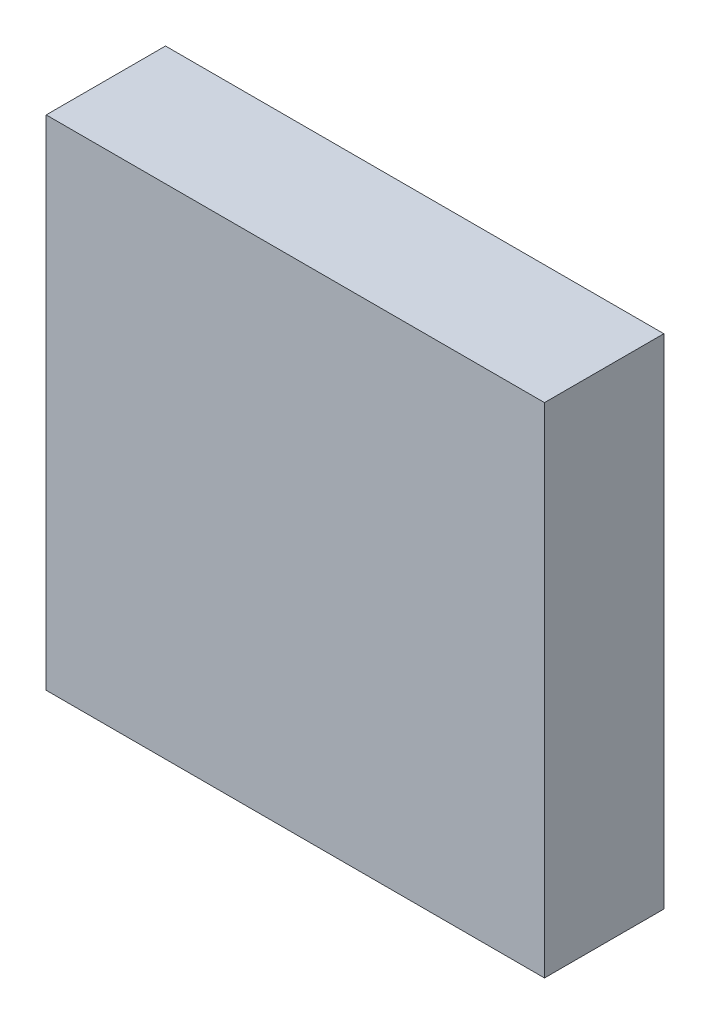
ISO-10303-21;
HEADER;
FILE_DESCRIPTION(('STEP AP214'),'2;1');
FILE_NAME('part.step','',(''),(''),'','','');
FILE_SCHEMA(('AUTOMOTIVE_DESIGN { 1 0 10303 214 1 1 1 1 }'));
ENDSEC;
DATA;
#1=APPLICATION_CONTEXT('core data for automotive mechanical design processes');
#2=APPLICATION_PROTOCOL_DEFINITION('international standard','automotive_design',2000,#1);
#3=PRODUCT_CONTEXT('',#1,'mechanical');
#4=PRODUCT('Part','Part','',(#3));
#5=PRODUCT_RELATED_PRODUCT_CATEGORY('part','',(#4));
#6=PRODUCT_DEFINITION_FORMATION('','',#4);
#7=PRODUCT_DEFINITION_CONTEXT('part definition',#1,'design');
#8=PRODUCT_DEFINITION('design','',#6,#7);
#9=PRODUCT_DEFINITION_SHAPE('','',#8);
#10=(LENGTH_UNIT() NAMED_UNIT(*) SI_UNIT(.MILLI.,.METRE.));
#11=(NAMED_UNIT(*) PLANE_ANGLE_UNIT() SI_UNIT($,.RADIAN.));
#12=(NAMED_UNIT(*) SI_UNIT($,.STERADIAN.) SOLID_ANGLE_UNIT());
#13=UNCERTAINTY_MEASURE_WITH_UNIT(LENGTH_MEASURE(1.E-05),#10,'distance_accuracy_value','');
#14=(GEOMETRIC_REPRESENTATION_CONTEXT(3) GLOBAL_UNCERTAINTY_ASSIGNED_CONTEXT((#13)) GLOBAL_UNIT_ASSIGNED_CONTEXT((#10,
#11,#12)) REPRESENTATION_CONTEXT('',''));
#15=CARTESIAN_POINT('',(0.,0.,0.));
#16=DIRECTION('',(0.,0.,1.));
#17=DIRECTION('',(1.,0.,0.));
#18=AXIS2_PLACEMENT_3D('',#15,#16,#17);
#19=CARTESIAN_POINT('',(-15.875,15.875,0.254));
#20=DIRECTION('',(0.,1.,0.));
#21=DIRECTION('',(-1.,0.,0.));
#22=AXIS2_PLACEMENT_3D('',#19,#20,#21);
#23=PLANE('',#22);
#24=DIRECTION('',(0.,0.,1.));
#25=VECTOR('',#24,1.);
#26=CARTESIAN_POINT('',(-15.875,15.875,0.254));
#27=LINE('',#26,#25);
#28=CARTESIAN_POINT('',(-15.875,15.875,0.));
#29=VERTEX_POINT('',#28);
#30=CARTESIAN_POINT('',(-15.875,15.875,7.60273));
#31=VERTEX_POINT('',#30);
#32=EDGE_CURVE('E61',#29,#31,#27,.T.);
#33=ORIENTED_EDGE('',*,*,#32,.T.);
#34=DIRECTION('',(-1.,0.,0.));
#35=VECTOR('',#34,1.);
#36=CARTESIAN_POINT('',(15.875,15.875,7.60273));
#37=LINE('',#36,#35);
#38=CARTESIAN_POINT('',(15.875,15.875,7.60273));
#39=VERTEX_POINT('',#38);
#40=EDGE_CURVE('E73',#39,#31,#37,.T.);
#41=ORIENTED_EDGE('',*,*,#40,.F.);
#42=DIRECTION('',(0.,0.,1.));
#43=VECTOR('',#42,1.);
#44=CARTESIAN_POINT('',(15.875,15.875,0.254));
#45=LINE('',#44,#43);
#46=CARTESIAN_POINT('',(15.875,15.875,0.));
#47=VERTEX_POINT('',#46);
#48=EDGE_CURVE('E80',#47,#39,#45,.T.);
#49=ORIENTED_EDGE('',*,*,#48,.F.);
#50=DIRECTION('',(-1.,0.,0.));
#51=VECTOR('',#50,1.);
#52=CARTESIAN_POINT('',(-15.875,15.875,0.));
#53=LINE('',#52,#51);
#54=EDGE_CURVE('E83',#47,#29,#53,.T.);
#55=ORIENTED_EDGE('',*,*,#54,.T.);
#56=EDGE_LOOP('',(#33,#41,#49,#55));
#57=FACE_BOUND('',#56,.T.);
#58=ADVANCED_FACE('F14',(#57),#23,.T.);
#59=CARTESIAN_POINT('',(15.875,15.875,0.254));
#60=DIRECTION('',(1.,0.,0.));
#61=DIRECTION('',(0.,1.,0.));
#62=AXIS2_PLACEMENT_3D('',#59,#60,#61);
#63=PLANE('',#62);
#64=ORIENTED_EDGE('',*,*,#48,.T.);
#65=DIRECTION('',(0.,1.,0.));
#66=VECTOR('',#65,1.);
#67=CARTESIAN_POINT('',(15.875,-15.875,7.60273));
#68=LINE('',#67,#66);
#69=CARTESIAN_POINT('',(15.875,-15.875,7.60273));
#70=VERTEX_POINT('',#69);
#71=EDGE_CURVE('E68',#70,#39,#68,.T.);
#72=ORIENTED_EDGE('',*,*,#71,.F.);
#73=DIRECTION('',(0.,0.,1.));
#74=VECTOR('',#73,1.);
#75=CARTESIAN_POINT('',(15.875,-15.875,0.254));
#76=LINE('',#75,#74);
#77=CARTESIAN_POINT('',(15.875,-15.875,0.));
#78=VERTEX_POINT('',#77);
#79=EDGE_CURVE('E9',#78,#70,#76,.T.);
#80=ORIENTED_EDGE('',*,*,#79,.F.);
#81=DIRECTION('',(0.,1.,0.));
#82=VECTOR('',#81,1.);
#83=CARTESIAN_POINT('',(15.875,15.875,0.));
#84=LINE('',#83,#82);
#85=EDGE_CURVE('E77',#78,#47,#84,.T.);
#86=ORIENTED_EDGE('',*,*,#85,.T.);
#87=EDGE_LOOP('',(#64,#72,#80,#86));
#88=FACE_BOUND('',#87,.T.);
#89=ADVANCED_FACE('F87',(#88),#63,.T.);
#90=CARTESIAN_POINT('',(-15.875,15.875,0.254));
#91=DIRECTION('',(-1.,0.,0.));
#92=DIRECTION('',(0.,-1.,0.));
#93=AXIS2_PLACEMENT_3D('',#90,#91,#92);
#94=PLANE('',#93);
#95=DIRECTION('',(0.,0.,1.));
#96=VECTOR('',#95,1.);
#97=CARTESIAN_POINT('',(-15.875,-15.875,0.254));
#98=LINE('',#97,#96);
#99=CARTESIAN_POINT('',(-15.875,-15.875,0.));
#100=VERTEX_POINT('',#99);
#101=CARTESIAN_POINT('',(-15.875,-15.875,7.60273));
#102=VERTEX_POINT('',#101);
#103=EDGE_CURVE('E23',#100,#102,#98,.T.);
#104=ORIENTED_EDGE('',*,*,#103,.T.);
#105=DIRECTION('',(0.,-1.,0.));
#106=VECTOR('',#105,1.);
#107=CARTESIAN_POINT('',(-15.875,15.875,7.60273));
#108=LINE('',#107,#106);
#109=EDGE_CURVE('E57',#31,#102,#108,.T.);
#110=ORIENTED_EDGE('',*,*,#109,.F.);
#111=ORIENTED_EDGE('',*,*,#32,.F.);
#112=DIRECTION('',(0.,-1.,0.));
#113=VECTOR('',#112,1.);
#114=CARTESIAN_POINT('',(-15.875,15.875,0.));
#115=LINE('',#114,#113);
#116=EDGE_CURVE('E59',#29,#100,#115,.T.);
#117=ORIENTED_EDGE('',*,*,#116,.T.);
#118=EDGE_LOOP('',(#104,#110,#111,#117));
#119=FACE_BOUND('',#118,.T.);
#120=ADVANCED_FACE('F55',(#119),#94,.T.);
#121=CARTESIAN_POINT('',(-15.875,-15.875,0.254));
#122=DIRECTION('',(0.,-1.,0.));
#123=DIRECTION('',(1.,0.,0.));
#124=AXIS2_PLACEMENT_3D('',#121,#122,#123);
#125=PLANE('',#124);
#126=ORIENTED_EDGE('',*,*,#79,.T.);
#127=DIRECTION('',(1.,0.,0.));
#128=VECTOR('',#127,1.);
#129=CARTESIAN_POINT('',(-15.875,-15.875,7.60273));
#130=LINE('',#129,#128);
#131=EDGE_CURVE('E64',#102,#70,#130,.T.);
#132=ORIENTED_EDGE('',*,*,#131,.F.);
#133=ORIENTED_EDGE('',*,*,#103,.F.);
#134=DIRECTION('',(1.,0.,0.));
#135=VECTOR('',#134,1.);
#136=CARTESIAN_POINT('',(-15.875,-15.875,0.));
#137=LINE('',#136,#135);
#138=EDGE_CURVE('E18',#100,#78,#137,.T.);
#139=ORIENTED_EDGE('',*,*,#138,.T.);
#140=EDGE_LOOP('',(#126,#132,#133,#139));
#141=FACE_BOUND('',#140,.T.);
#142=ADVANCED_FACE('F65',(#141),#125,.T.);
#143=CARTESIAN_POINT('',(0.,0.,0.));
#144=DIRECTION('',(0.,0.,1.));
#145=DIRECTION('',(0.,-1.,0.));
#146=AXIS2_PLACEMENT_3D('',#143,#144,#145);
#147=PLANE('',#146);
#148=ORIENTED_EDGE('',*,*,#85,.F.);
#149=ORIENTED_EDGE('',*,*,#138,.F.);
#150=ORIENTED_EDGE('',*,*,#116,.F.);
#151=ORIENTED_EDGE('',*,*,#54,.F.);
#152=EDGE_LOOP('',(#148,#149,#150,#151));
#153=FACE_BOUND('',#152,.T.);
#154=ADVANCED_FACE('F16',(#153),#147,.F.);
#155=CARTESIAN_POINT('',(0.,0.,7.60273));
#156=DIRECTION('',(0.,0.,1.));
#157=DIRECTION('',(1.,0.,0.));
#158=AXIS2_PLACEMENT_3D('',#155,#156,#157);
#159=PLANE('',#158);
#160=ORIENTED_EDGE('',*,*,#109,.T.);
#161=ORIENTED_EDGE('',*,*,#131,.T.);
#162=ORIENTED_EDGE('',*,*,#71,.T.);
#163=ORIENTED_EDGE('',*,*,#40,.T.);
#164=EDGE_LOOP('',(#160,#161,#162,#163));
#165=FACE_BOUND('',#164,.T.);
#166=ADVANCED_FACE('F71',(#165),#159,.T.);
#167=CLOSED_SHELL('',(#58,#89,#120,#142,#154,#166));
#168=MANIFOLD_SOLID_BREP('B1',#167);
#169=ADVANCED_BREP_SHAPE_REPRESENTATION('',(#18,#168),#14);
#170=SHAPE_DEFINITION_REPRESENTATION(#9,#169);
ENDSEC;
END-ISO-10303-21;
